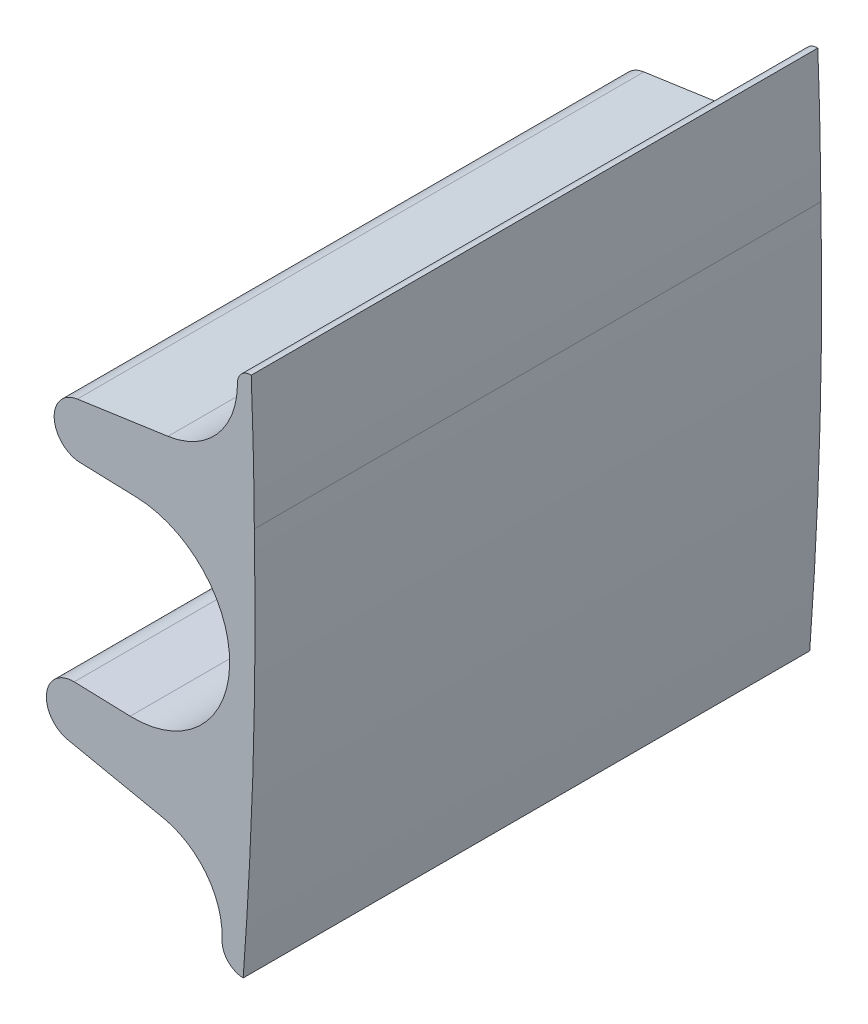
from build123d import *

# Parameters (mm, degrees)
EXTRUSION1_DEPTH = 21


with BuildPart() as part:
    # Esquisse1 → Extrusion1 (new, symmetric)
    with BuildSketch(Plane.XY.offset(22.2)):
        with BuildLine():
            Line((85.651665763, 11.255850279), (92.374705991, 12.223896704))
            ThreePointArc((92.374705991, 12.223896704), (95.992002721, 14.162959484), (97.516607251, 17.973521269))
            Line((97.516607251, 17.973521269), (97.526195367, 18.277549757))
            ThreePointArc((97.526195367, 18.277549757), (97.83741193, 18.966614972), (98.544717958, 19.233794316))
            add(Edge.make_bspline(
                [(98.773452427, 9.475717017), (98.749719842, 12.742682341), (98.672593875, 15.995125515), (98.544717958, 19.233794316)],
                knots=[-4.4037e-05, -4.4037e-05, -4.4037e-05, -4.4037e-05, 0.069622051, 0.069622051, 0.069622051, 0.069622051], degree=3))
            add(Edge.make_bspline(
                [(97.947559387, -19.766762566), (98.676177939, -9.903650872), (98.962991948, -0.145944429), (98.773452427, 9.475717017)],
                knots=[0.857747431, 0.857747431, 0.857747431, 0.857747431, 1.000030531, 1.000030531, 1.000030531, 1.000030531], degree=3))
            ThreePointArc((97.947559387, -19.766762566), (96.817322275, -19.256290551), (96.379082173, -18.096134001))
            Line((96.379082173, -18.096134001), (96.381958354, -18.004933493))
            ThreePointArc((96.381958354, -18.004933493), (95.207280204, -14.430798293), (92.010014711, -12.447920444))
            Line((92.010014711, -12.447920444), (84.950657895, -10.972329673))
            ThreePointArc((84.950657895, -10.972329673), (83.37396154, -8.777612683), (85.422908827, -7.015633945))
            Line((85.422908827, -7.015633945), (89.57084662, -7.146447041))
            ThreePointArc((89.57084662, -7.146447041), (96.94267044, -0.225376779), (90.021600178, 7.146447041))
            Line((90.021600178, 7.146447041), (85.873662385, 7.277260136))
            ThreePointArc((85.873662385, 7.277260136), (83.939810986, 9.164843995), (85.651665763, 11.255850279))
        make_face()
    extrude(amount=EXTRUSION1_DEPTH, both=True)


solid = part.part
